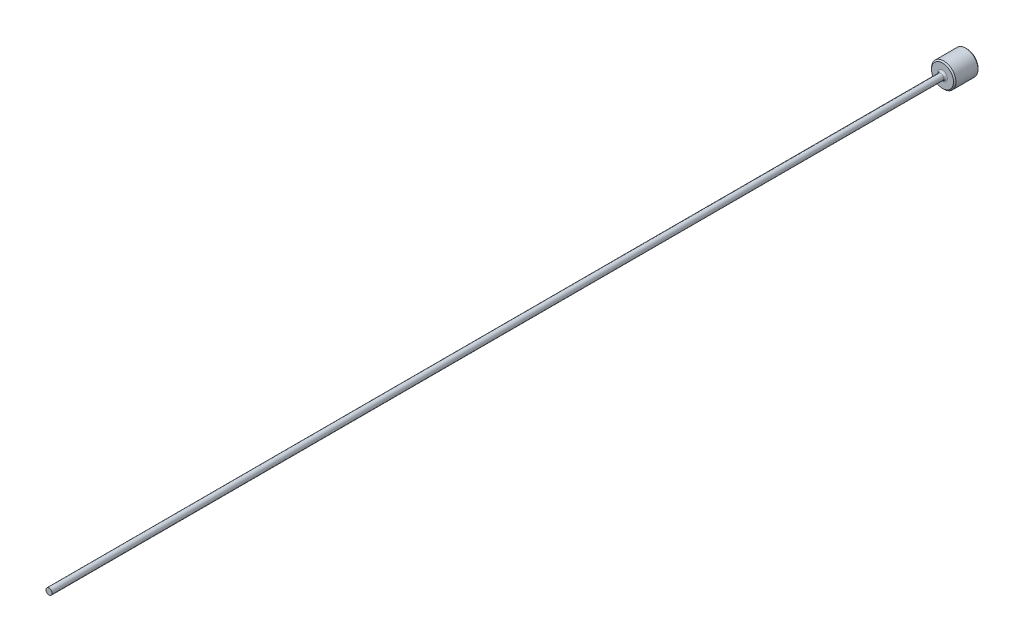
ISO-10303-21;
HEADER;
FILE_DESCRIPTION(('STEP AP214'),'2;1');
FILE_NAME('part.step','',(''),(''),'','','');
FILE_SCHEMA(('AUTOMOTIVE_DESIGN { 1 0 10303 214 1 1 1 1 }'));
ENDSEC;
DATA;
#1=APPLICATION_CONTEXT('core data for automotive mechanical design processes');
#2=APPLICATION_PROTOCOL_DEFINITION('international standard','automotive_design',2000,#1);
#3=PRODUCT_CONTEXT('',#1,'mechanical');
#4=PRODUCT('Part','Part','',(#3));
#5=PRODUCT_RELATED_PRODUCT_CATEGORY('part','',(#4));
#6=PRODUCT_DEFINITION_FORMATION('','',#4);
#7=PRODUCT_DEFINITION_CONTEXT('part definition',#1,'design');
#8=PRODUCT_DEFINITION('design','',#6,#7);
#9=PRODUCT_DEFINITION_SHAPE('','',#8);
#10=(LENGTH_UNIT() NAMED_UNIT(*) SI_UNIT(.MILLI.,.METRE.));
#11=(NAMED_UNIT(*) PLANE_ANGLE_UNIT() SI_UNIT($,.RADIAN.));
#12=(NAMED_UNIT(*) SI_UNIT($,.STERADIAN.) SOLID_ANGLE_UNIT());
#13=UNCERTAINTY_MEASURE_WITH_UNIT(LENGTH_MEASURE(1.E-05),#10,'distance_accuracy_value','');
#14=(GEOMETRIC_REPRESENTATION_CONTEXT(3) GLOBAL_UNCERTAINTY_ASSIGNED_CONTEXT((#13)) GLOBAL_UNIT_ASSIGNED_CONTEXT((#10,
#11,#12)) REPRESENTATION_CONTEXT('',''));
#15=CARTESIAN_POINT('',(0.,0.,0.));
#16=DIRECTION('',(0.,0.,1.));
#17=DIRECTION('',(1.,0.,0.));
#18=AXIS2_PLACEMENT_3D('',#15,#16,#17);
#19=CARTESIAN_POINT('',(0.,0.499999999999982,150.));
#20=DIRECTION('',(0.,0.,-1.));
#21=DIRECTION('',(-1.,0.,0.));
#22=AXIS2_PLACEMENT_3D('',#19,#20,#21);
#23=PLANE('',#22);
#24=CARTESIAN_POINT('',(0.,0.,150.));
#25=DIRECTION('',(0.,0.,1.));
#26=DIRECTION('',(1.,0.,0.));
#27=AXIS2_PLACEMENT_3D('',#24,#25,#26);
#28=CIRCLE('',#27,0.499999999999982);
#29=CARTESIAN_POINT('',(0.499999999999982,0.,150.));
#30=VERTEX_POINT('',#29);
#31=EDGE_CURVE('E50',#30,#30,#28,.T.);
#32=ORIENTED_EDGE('',*,*,#31,.T.);
#33=EDGE_LOOP('',(#32));
#34=FACE_BOUND('',#33,.T.);
#35=ADVANCED_FACE('F30',(#34),#23,.F.);
#36=CARTESIAN_POINT('',(0.,0.,109.050628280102));
#37=DIRECTION('',(0.,0.,1.));
#38=DIRECTION('',(1.,0.,0.));
#39=AXIS2_PLACEMENT_3D('',#36,#37,#38);
#40=CYLINDRICAL_SURFACE('',#39,0.499999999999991);
#41=ORIENTED_EDGE('',*,*,#31,.F.);
#42=EDGE_LOOP('',(#41));
#43=FACE_BOUND('',#42,.T.);
#44=CARTESIAN_POINT('',(0.,0.,4.3));
#45=DIRECTION('',(0.,0.,1.));
#46=DIRECTION('',(1.,0.,0.));
#47=AXIS2_PLACEMENT_3D('',#44,#45,#46);
#48=CIRCLE('',#47,0.5);
#49=CARTESIAN_POINT('',(0.5,0.,4.3));
#50=VERTEX_POINT('',#49);
#51=EDGE_CURVE('E53',#50,#50,#48,.T.);
#52=ORIENTED_EDGE('',*,*,#51,.T.);
#53=EDGE_LOOP('',(#52));
#54=FACE_BOUND('',#53,.T.);
#55=ADVANCED_FACE('F73',(#43,#54),#40,.T.);
#56=CARTESIAN_POINT('',(0.,0.,4.3));
#57=DIRECTION('',(0.,0.,1.));
#58=DIRECTION('',(1.,0.,0.));
#59=AXIS2_PLACEMENT_3D('',#56,#57,#58);
#60=TOROIDAL_SURFACE('',#59,0.8,0.3);
#61=ORIENTED_EDGE('',*,*,#51,.F.);
#62=EDGE_LOOP('',(#61));
#63=FACE_BOUND('',#62,.T.);
#64=CARTESIAN_POINT('',(0.,0.,4.));
#65=DIRECTION('',(0.,0.,1.));
#66=DIRECTION('',(1.,0.,0.));
#67=AXIS2_PLACEMENT_3D('',#64,#65,#66);
#68=CIRCLE('',#67,0.8);
#69=CARTESIAN_POINT('',(0.8,0.,4.));
#70=VERTEX_POINT('',#69);
#71=EDGE_CURVE('E56',#70,#70,#68,.T.);
#72=ORIENTED_EDGE('',*,*,#71,.T.);
#73=EDGE_LOOP('',(#72));
#74=FACE_BOUND('',#73,.T.);
#75=ADVANCED_FACE('F60',(#63,#74),#60,.F.);
#76=CARTESIAN_POINT('',(0.,2.,4.));
#77=DIRECTION('',(0.,0.,-1.));
#78=DIRECTION('',(-1.,0.,0.));
#79=AXIS2_PLACEMENT_3D('',#76,#77,#78);
#80=PLANE('',#79);
#81=CARTESIAN_POINT('',(0.,0.,4.));
#82=DIRECTION('',(0.,0.,-1.));
#83=DIRECTION('',(-1.,0.,0.));
#84=AXIS2_PLACEMENT_3D('',#81,#82,#83);
#85=CIRCLE('',#84,1.80000000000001);
#86=CARTESIAN_POINT('',(-1.80000000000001,0.,4.));
#87=VERTEX_POINT('',#86);
#88=EDGE_CURVE('E10',#87,#87,#85,.F.);
#89=ORIENTED_EDGE('',*,*,#88,.T.);
#90=EDGE_LOOP('',(#89));
#91=FACE_BOUND('',#90,.T.);
#92=ORIENTED_EDGE('',*,*,#71,.F.);
#93=EDGE_LOOP('',(#92));
#94=FACE_BOUND('',#93,.T.);
#95=ADVANCED_FACE('F62',(#91,#94),#80,.F.);
#96=CARTESIAN_POINT('',(0.,0.,109.050628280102));
#97=DIRECTION('',(0.,0.,1.));
#98=DIRECTION('',(1.,0.,0.));
#99=AXIS2_PLACEMENT_3D('',#96,#97,#98);
#100=CYLINDRICAL_SURFACE('',#99,2.);
#101=CARTESIAN_POINT('',(0.,0.,0.20000000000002));
#102=DIRECTION('',(0.,0.,1.));
#103=DIRECTION('',(1.,0.,0.));
#104=AXIS2_PLACEMENT_3D('',#101,#102,#103);
#105=CIRCLE('',#104,2.);
#106=CARTESIAN_POINT('',(2.,0.,0.20000000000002));
#107=VERTEX_POINT('',#106);
#108=EDGE_CURVE('E41',#107,#107,#105,.T.);
#109=ORIENTED_EDGE('',*,*,#108,.T.);
#110=EDGE_LOOP('',(#109));
#111=FACE_BOUND('',#110,.T.);
#112=CARTESIAN_POINT('',(0.,0.,3.80000000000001));
#113=DIRECTION('',(0.,0.,-1.));
#114=DIRECTION('',(-1.,0.,0.));
#115=AXIS2_PLACEMENT_3D('',#112,#113,#114);
#116=CIRCLE('',#115,2.);
#117=CARTESIAN_POINT('',(-2.,0.,3.80000000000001));
#118=VERTEX_POINT('',#117);
#119=EDGE_CURVE('E45',#118,#118,#116,.T.);
#120=ORIENTED_EDGE('',*,*,#119,.T.);
#121=EDGE_LOOP('',(#120));
#122=FACE_BOUND('',#121,.T.);
#123=ADVANCED_FACE('F64',(#111,#122),#100,.T.);
#124=CARTESIAN_POINT('',(0.,0.,0.));
#125=DIRECTION('',(0.,0.,1.));
#126=DIRECTION('',(1.,0.,0.));
#127=AXIS2_PLACEMENT_3D('',#124,#125,#126);
#128=PLANE('',#127);
#129=CARTESIAN_POINT('',(0.,0.,0.));
#130=DIRECTION('',(0.,0.,1.));
#131=DIRECTION('',(1.,0.,0.));
#132=AXIS2_PLACEMENT_3D('',#129,#130,#131);
#133=CIRCLE('',#132,1.79999999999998);
#134=CARTESIAN_POINT('',(1.79999999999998,0.,0.));
#135=VERTEX_POINT('',#134);
#136=EDGE_CURVE('E37',#135,#135,#133,.F.);
#137=ORIENTED_EDGE('',*,*,#136,.T.);
#138=EDGE_LOOP('',(#137));
#139=FACE_BOUND('',#138,.T.);
#140=ADVANCED_FACE('F70',(#139),#128,.F.);
#141=CARTESIAN_POINT('',(0.,0.,0.20000000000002));
#142=DIRECTION('',(0.,0.,1.));
#143=DIRECTION('',(1.,0.,0.));
#144=AXIS2_PLACEMENT_3D('',#141,#142,#143);
#145=CONICAL_SURFACE('',#144,2.,0.785398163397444);
#146=ORIENTED_EDGE('',*,*,#136,.F.);
#147=EDGE_LOOP('',(#146));
#148=FACE_BOUND('',#147,.T.);
#149=ORIENTED_EDGE('',*,*,#108,.F.);
#150=EDGE_LOOP('',(#149));
#151=FACE_BOUND('',#150,.T.);
#152=ADVANCED_FACE('F84',(#148,#151),#145,.T.);
#153=CARTESIAN_POINT('',(0.,0.,4.));
#154=DIRECTION('',(0.,0.,-1.));
#155=DIRECTION('',(-1.,0.,0.));
#156=AXIS2_PLACEMENT_3D('',#153,#154,#155);
#157=CONICAL_SURFACE('',#156,1.80000000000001,0.785398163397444);
#158=ORIENTED_EDGE('',*,*,#119,.F.);
#159=EDGE_LOOP('',(#158));
#160=FACE_BOUND('',#159,.T.);
#161=ORIENTED_EDGE('',*,*,#88,.F.);
#162=EDGE_LOOP('',(#161));
#163=FACE_BOUND('',#162,.T.);
#164=ADVANCED_FACE('F32',(#160,#163),#157,.T.);
#165=CLOSED_SHELL('',(#35,#55,#75,#95,#123,#140,#152,#164));
#166=MANIFOLD_SOLID_BREP('B2',#165);
#167=ADVANCED_BREP_SHAPE_REPRESENTATION('',(#18,#166),#14);
#168=SHAPE_DEFINITION_REPRESENTATION(#9,#167);
ENDSEC;
END-ISO-10303-21;
